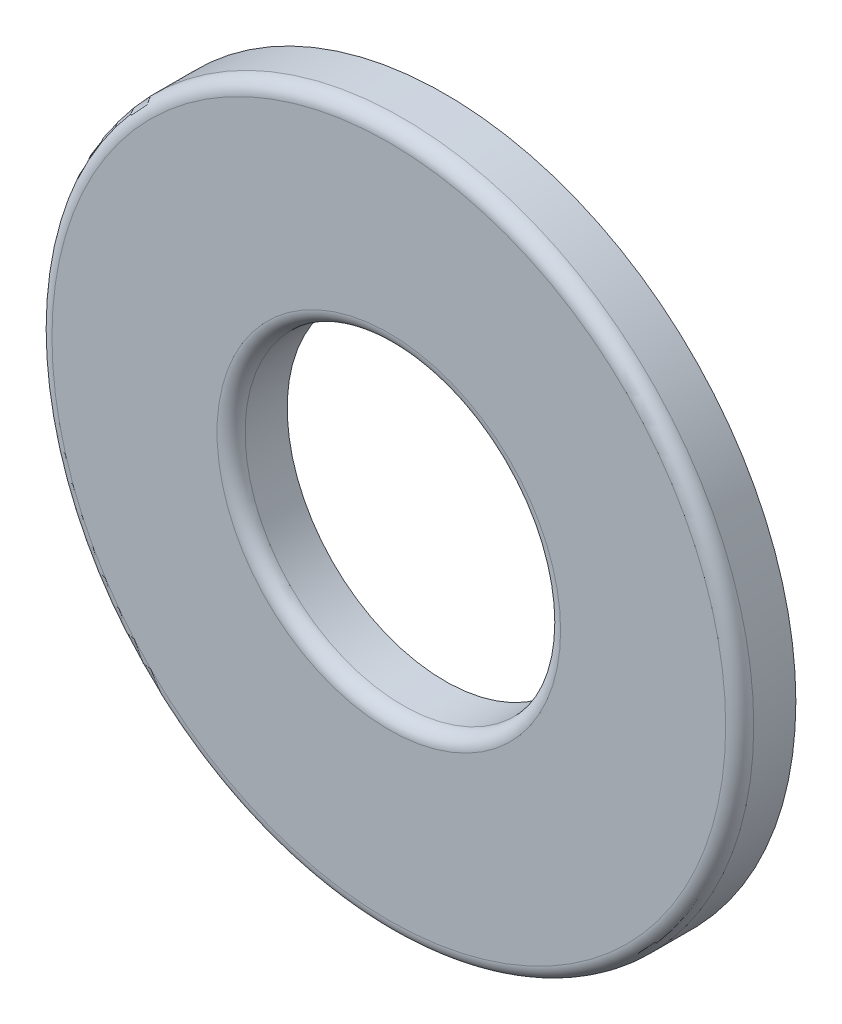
from build123d import *

# Parameters (mm, degrees)
BOSS_EXTRUDE1_DEPTH      = 0.635
BOSS_EXTRUDE1_DEPTH_BACK = 0.635
SKETCH3_R                = 7.9375
SKETCH3_R_2              = 3.5687
FILLET1_R                = 0.3175


with BuildPart() as part:
    # Sketch3 → Boss-Extrude1 (new, two sides: drawn at the far end of the back side and taken through both)
    with BuildSketch(Plane.XY.offset(-BOSS_EXTRUDE1_DEPTH_BACK)):
        Circle(SKETCH3_R)
        Circle(SKETCH3_R_2, mode=Mode.SUBTRACT)
    extrude(amount=BOSS_EXTRUDE1_DEPTH + BOSS_EXTRUDE1_DEPTH_BACK)

    # Fillet1
    fillet1_edges = [part.edges().sort_by_distance(p)[0] for p in [
        (-7.9375, 0, 0.635),
        (-3.5687, 0, 0.635),
    ]]
    fillet(fillet1_edges, radius=FILLET1_R)


solid = part.part
